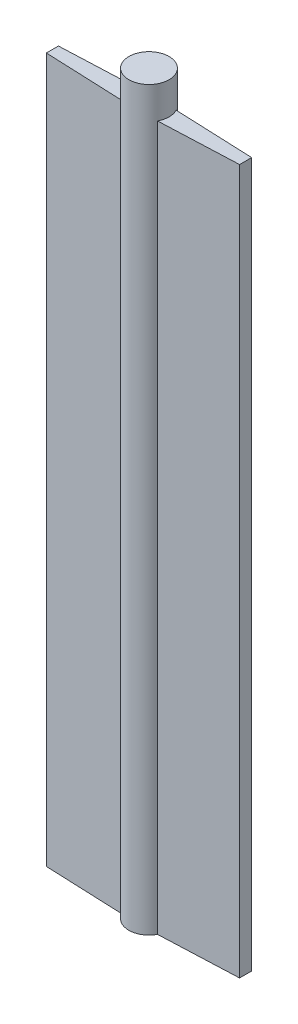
ISO-10303-21;
HEADER;
FILE_DESCRIPTION(('STEP AP214'),'2;1');
FILE_NAME('part.step','',(''),(''),'','','');
FILE_SCHEMA(('AUTOMOTIVE_DESIGN { 1 0 10303 214 1 1 1 1 }'));
ENDSEC;
DATA;
#1=APPLICATION_CONTEXT('core data for automotive mechanical design processes');
#2=APPLICATION_PROTOCOL_DEFINITION('international standard','automotive_design',2000,#1);
#3=PRODUCT_CONTEXT('',#1,'mechanical');
#4=PRODUCT('Part','Part','',(#3));
#5=PRODUCT_RELATED_PRODUCT_CATEGORY('part','',(#4));
#6=PRODUCT_DEFINITION_FORMATION('','',#4);
#7=PRODUCT_DEFINITION_CONTEXT('part definition',#1,'design');
#8=PRODUCT_DEFINITION('design','',#6,#7);
#9=PRODUCT_DEFINITION_SHAPE('','',#8);
#10=(LENGTH_UNIT() NAMED_UNIT(*) SI_UNIT(.MILLI.,.METRE.));
#11=(NAMED_UNIT(*) PLANE_ANGLE_UNIT() SI_UNIT($,.RADIAN.));
#12=(NAMED_UNIT(*) SI_UNIT($,.STERADIAN.) SOLID_ANGLE_UNIT());
#13=UNCERTAINTY_MEASURE_WITH_UNIT(LENGTH_MEASURE(1.E-05),#10,'distance_accuracy_value','');
#14=(GEOMETRIC_REPRESENTATION_CONTEXT(3) GLOBAL_UNCERTAINTY_ASSIGNED_CONTEXT((#13)) GLOBAL_UNIT_ASSIGNED_CONTEXT((#10,
#11,#12)) REPRESENTATION_CONTEXT('',''));
#15=CARTESIAN_POINT('',(0.,0.,0.));
#16=DIRECTION('',(0.,0.,1.));
#17=DIRECTION('',(1.,0.,0.));
#18=AXIS2_PLACEMENT_3D('',#15,#16,#17);
#19=CARTESIAN_POINT('',(0.,222.25,0.));
#20=DIRECTION('',(0.,1.,0.));
#21=DIRECTION('',(0.,0.,1.));
#22=AXIS2_PLACEMENT_3D('',#19,#20,#21);
#23=PLANE('',#22);
#24=CARTESIAN_POINT('',(0.,222.25,0.));
#25=DIRECTION('',(0.,1.,0.));
#26=DIRECTION('',(0.,0.,1.));
#27=AXIS2_PLACEMENT_3D('',#24,#25,#26);
#28=CIRCLE('',#27,6.35);
#29=CARTESIAN_POINT('',(5.62814310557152,222.25,2.94049403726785));
#30=VERTEX_POINT('',#29);
#31=CARTESIAN_POINT('',(5.62814310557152,222.25,-2.94049403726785));
#32=VERTEX_POINT('',#31);
#33=EDGE_CURVE('E80',#30,#32,#28,.T.);
#34=ORIENTED_EDGE('',*,*,#33,.F.);
#35=DIRECTION('',(-0.999133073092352,0.,0.0416305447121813));
#36=VECTOR('',#35,1.);
#37=CARTESIAN_POINT('',(0.132062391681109,222.25,3.16949740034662));
#38=LINE('',#37,#36);
#39=CARTESIAN_POINT('',(30.48,222.25,1.905));
#40=VERTEX_POINT('',#39);
#41=EDGE_CURVE('E182',#40,#30,#38,.T.);
#42=ORIENTED_EDGE('',*,*,#41,.F.);
#43=DIRECTION('',(0.,0.,1.));
#44=VECTOR('',#43,1.);
#45=CARTESIAN_POINT('',(30.48,222.25,0.));
#46=LINE('',#45,#44);
#47=CARTESIAN_POINT('',(30.48,222.25,-1.905));
#48=VERTEX_POINT('',#47);
#49=EDGE_CURVE('E205',#48,#40,#46,.T.);
#50=ORIENTED_EDGE('',*,*,#49,.F.);
#51=DIRECTION('',(0.999133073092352,0.,0.0416305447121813));
#52=VECTOR('',#51,1.);
#53=CARTESIAN_POINT('',(0.132062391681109,222.25,-3.16949740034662));
#54=LINE('',#53,#52);
#55=EDGE_CURVE('E177',#32,#48,#54,.T.);
#56=ORIENTED_EDGE('',*,*,#55,.F.);
#57=EDGE_LOOP('',(#34,#42,#50,#56));
#58=FACE_BOUND('',#57,.T.);
#59=ADVANCED_FACE('F68',(#58),#23,.T.);
#60=CARTESIAN_POINT('',(0.132062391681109,222.25,3.16949740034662));
#61=DIRECTION('',(0.0416305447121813,0.,0.999133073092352));
#62=DIRECTION('',(0.999133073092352,0.,-0.0416305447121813));
#63=AXIS2_PLACEMENT_3D('',#60,#61,#62);
#64=PLANE('',#63);
#65=DIRECTION('',(-0.999133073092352,0.,0.0416305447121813));
#66=VECTOR('',#65,1.);
#67=CARTESIAN_POINT('',(0.132062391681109,0.,3.16949740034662));
#68=LINE('',#67,#66);
#69=CARTESIAN_POINT('',(30.48,0.,1.905));
#70=VERTEX_POINT('',#69);
#71=CARTESIAN_POINT('',(5.62814310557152,0.,2.94049403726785));
#72=VERTEX_POINT('',#71);
#73=EDGE_CURVE('E154',#70,#72,#68,.T.);
#74=ORIENTED_EDGE('',*,*,#73,.F.);
#75=DIRECTION('',(0.,-1.,0.));
#76=VECTOR('',#75,1.);
#77=CARTESIAN_POINT('',(30.48,222.25,1.905));
#78=LINE('',#77,#76);
#79=EDGE_CURVE('E186',#40,#70,#78,.T.);
#80=ORIENTED_EDGE('',*,*,#79,.F.);
#81=ORIENTED_EDGE('',*,*,#41,.T.);
#82=DIRECTION('',(0.,-1.,0.));
#83=VECTOR('',#82,1.);
#84=CARTESIAN_POINT('',(5.62814310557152,222.25,2.94049403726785));
#85=LINE('',#84,#83);
#86=EDGE_CURVE('E78',#30,#72,#85,.T.);
#87=ORIENTED_EDGE('',*,*,#86,.T.);
#88=EDGE_LOOP('',(#74,#80,#81,#87));
#89=FACE_BOUND('',#88,.T.);
#90=ADVANCED_FACE('F216',(#89),#64,.T.);
#91=CARTESIAN_POINT('',(30.48,222.25,0.));
#92=DIRECTION('',(1.,0.,0.));
#93=DIRECTION('',(0.,0.,-1.));
#94=AXIS2_PLACEMENT_3D('',#91,#92,#93);
#95=PLANE('',#94);
#96=DIRECTION('',(0.,0.,1.));
#97=VECTOR('',#96,1.);
#98=CARTESIAN_POINT('',(30.48,0.,0.));
#99=LINE('',#98,#97);
#100=CARTESIAN_POINT('',(30.48,0.,-1.905));
#101=VERTEX_POINT('',#100);
#102=EDGE_CURVE('E172',#101,#70,#99,.T.);
#103=ORIENTED_EDGE('',*,*,#102,.F.);
#104=DIRECTION('',(0.,-1.,0.));
#105=VECTOR('',#104,1.);
#106=CARTESIAN_POINT('',(30.48,222.25,-1.905));
#107=LINE('',#106,#105);
#108=EDGE_CURVE('E184',#48,#101,#107,.T.);
#109=ORIENTED_EDGE('',*,*,#108,.F.);
#110=ORIENTED_EDGE('',*,*,#49,.T.);
#111=ORIENTED_EDGE('',*,*,#79,.T.);
#112=EDGE_LOOP('',(#103,#109,#110,#111));
#113=FACE_BOUND('',#112,.T.);
#114=ADVANCED_FACE('F218',(#113),#95,.T.);
#115=CARTESIAN_POINT('',(0.132062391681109,222.25,-3.16949740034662));
#116=DIRECTION('',(0.0416305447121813,0.,-0.999133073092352));
#117=DIRECTION('',(-0.999133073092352,0.,-0.0416305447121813));
#118=AXIS2_PLACEMENT_3D('',#115,#116,#117);
#119=PLANE('',#118);
#120=DIRECTION('',(0.999133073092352,0.,0.0416305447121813));
#121=VECTOR('',#120,1.);
#122=CARTESIAN_POINT('',(0.132062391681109,0.,-3.16949740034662));
#123=LINE('',#122,#121);
#124=CARTESIAN_POINT('',(5.62814310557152,0.,-2.94049403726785));
#125=VERTEX_POINT('',#124);
#126=EDGE_CURVE('E174',#125,#101,#123,.T.);
#127=ORIENTED_EDGE('',*,*,#126,.F.);
#128=DIRECTION('',(0.,-1.,0.));
#129=VECTOR('',#128,1.);
#130=CARTESIAN_POINT('',(5.62814310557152,222.25,-2.94049403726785));
#131=LINE('',#130,#129);
#132=EDGE_CURVE('E88',#32,#125,#131,.T.);
#133=ORIENTED_EDGE('',*,*,#132,.F.);
#134=ORIENTED_EDGE('',*,*,#55,.T.);
#135=ORIENTED_EDGE('',*,*,#108,.T.);
#136=EDGE_LOOP('',(#127,#133,#134,#135));
#137=FACE_BOUND('',#136,.T.);
#138=ADVANCED_FACE('F209',(#137),#119,.T.);
#139=CARTESIAN_POINT('',(0.,0.,0.));
#140=DIRECTION('',(0.,1.,0.));
#141=DIRECTION('',(0.,0.,1.));
#142=AXIS2_PLACEMENT_3D('',#139,#140,#141);
#143=PLANE('',#142);
#144=ORIENTED_EDGE('',*,*,#73,.T.);
#145=CARTESIAN_POINT('',(0.,0.,0.));
#146=DIRECTION('',(0.,1.,0.));
#147=DIRECTION('',(0.,0.,1.));
#148=AXIS2_PLACEMENT_3D('',#145,#146,#147);
#149=CIRCLE('',#148,6.35);
#150=CARTESIAN_POINT('',(-5.62814310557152,0.,2.94049403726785));
#151=VERTEX_POINT('',#150);
#152=EDGE_CURVE('E72',#151,#72,#149,.T.);
#153=ORIENTED_EDGE('',*,*,#152,.F.);
#154=DIRECTION('',(0.999133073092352,0.,0.0416305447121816));
#155=VECTOR('',#154,1.);
#156=CARTESIAN_POINT('',(-0.13206239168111,0.,3.16949740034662));
#157=LINE('',#156,#155);
#158=CARTESIAN_POINT('',(-30.48,0.,1.90499999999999));
#159=VERTEX_POINT('',#158);
#160=EDGE_CURVE('E151',#159,#151,#157,.T.);
#161=ORIENTED_EDGE('',*,*,#160,.F.);
#162=DIRECTION('',(0.,0.,1.));
#163=VECTOR('',#162,1.);
#164=CARTESIAN_POINT('',(-30.48,0.,0.));
#165=LINE('',#164,#163);
#166=CARTESIAN_POINT('',(-30.48,0.,-1.90499999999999));
#167=VERTEX_POINT('',#166);
#168=EDGE_CURVE('E130',#167,#159,#165,.T.);
#169=ORIENTED_EDGE('',*,*,#168,.F.);
#170=DIRECTION('',(-0.999133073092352,0.,0.0416305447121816));
#171=VECTOR('',#170,1.);
#172=CARTESIAN_POINT('',(-0.13206239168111,0.,-3.16949740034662));
#173=LINE('',#172,#171);
#174=CARTESIAN_POINT('',(-5.62814310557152,0.,-2.94049403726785));
#175=VERTEX_POINT('',#174);
#176=EDGE_CURVE('E155',#175,#167,#173,.T.);
#177=ORIENTED_EDGE('',*,*,#176,.F.);
#178=EDGE_CURVE('E156',#125,#175,#149,.T.);
#179=ORIENTED_EDGE('',*,*,#178,.F.);
#180=ORIENTED_EDGE('',*,*,#126,.T.);
#181=ORIENTED_EDGE('',*,*,#102,.T.);
#182=EDGE_LOOP('',(#144,#153,#161,#169,#177,#179,#180,#181));
#183=FACE_BOUND('',#182,.T.);
#184=ADVANCED_FACE('F150',(#183),#143,.F.);
#185=CARTESIAN_POINT('',(-5.62814310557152,222.25,-2.94049403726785));
#186=VERTEX_POINT('',#185);
#187=CARTESIAN_POINT('',(-5.62814310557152,222.25,2.94049403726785));
#188=VERTEX_POINT('',#187);
#189=EDGE_CURVE('E12',#186,#188,#28,.T.);
#190=ORIENTED_EDGE('',*,*,#189,.F.);
#191=DIRECTION('',(-0.999133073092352,0.,0.0416305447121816));
#192=VECTOR('',#191,1.);
#193=CARTESIAN_POINT('',(-0.13206239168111,222.25,-3.16949740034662));
#194=LINE('',#193,#192);
#195=CARTESIAN_POINT('',(-30.48,222.25,-1.90499999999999));
#196=VERTEX_POINT('',#195);
#197=EDGE_CURVE('E158',#186,#196,#194,.T.);
#198=ORIENTED_EDGE('',*,*,#197,.T.);
#199=DIRECTION('',(0.,0.,1.));
#200=VECTOR('',#199,1.);
#201=CARTESIAN_POINT('',(-30.48,222.25,0.));
#202=LINE('',#201,#200);
#203=CARTESIAN_POINT('',(-30.48,222.25,1.90499999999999));
#204=VERTEX_POINT('',#203);
#205=EDGE_CURVE('E160',#196,#204,#202,.T.);
#206=ORIENTED_EDGE('',*,*,#205,.T.);
#207=DIRECTION('',(0.999133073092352,0.,0.0416305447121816));
#208=VECTOR('',#207,1.);
#209=CARTESIAN_POINT('',(-0.13206239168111,222.25,3.16949740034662));
#210=LINE('',#209,#208);
#211=EDGE_CURVE('E146',#204,#188,#210,.T.);
#212=ORIENTED_EDGE('',*,*,#211,.T.);
#213=EDGE_LOOP('',(#190,#198,#206,#212));
#214=FACE_BOUND('',#213,.T.);
#215=ADVANCED_FACE('F196',(#214),#23,.T.);
#216=CARTESIAN_POINT('',(-30.48,222.25,0.));
#217=DIRECTION('',(1.,0.,0.));
#218=DIRECTION('',(0.,0.,-1.));
#219=AXIS2_PLACEMENT_3D('',#216,#217,#218);
#220=PLANE('',#219);
#221=ORIENTED_EDGE('',*,*,#168,.T.);
#222=DIRECTION('',(0.,-1.,0.));
#223=VECTOR('',#222,1.);
#224=CARTESIAN_POINT('',(-30.48,222.25,1.90499999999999));
#225=LINE('',#224,#223);
#226=EDGE_CURVE('E145',#204,#159,#225,.T.);
#227=ORIENTED_EDGE('',*,*,#226,.F.);
#228=ORIENTED_EDGE('',*,*,#205,.F.);
#229=DIRECTION('',(0.,-1.,0.));
#230=VECTOR('',#229,1.);
#231=CARTESIAN_POINT('',(-30.48,222.25,-1.90499999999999));
#232=LINE('',#231,#230);
#233=EDGE_CURVE('E166',#196,#167,#232,.T.);
#234=ORIENTED_EDGE('',*,*,#233,.T.);
#235=EDGE_LOOP('',(#221,#227,#228,#234));
#236=FACE_BOUND('',#235,.T.);
#237=ADVANCED_FACE('F194',(#236),#220,.F.);
#238=CARTESIAN_POINT('',(-0.13206239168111,222.25,3.16949740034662));
#239=DIRECTION('',(0.0416305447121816,0.,-0.999133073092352));
#240=DIRECTION('',(-0.999133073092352,0.,-0.0416305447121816));
#241=AXIS2_PLACEMENT_3D('',#238,#239,#240);
#242=PLANE('',#241);
#243=ORIENTED_EDGE('',*,*,#160,.T.);
#244=DIRECTION('',(0.,-1.,0.));
#245=VECTOR('',#244,1.);
#246=CARTESIAN_POINT('',(-5.62814310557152,222.25,2.94049403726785));
#247=LINE('',#246,#245);
#248=EDGE_CURVE('E135',#188,#151,#247,.T.);
#249=ORIENTED_EDGE('',*,*,#248,.F.);
#250=ORIENTED_EDGE('',*,*,#211,.F.);
#251=ORIENTED_EDGE('',*,*,#226,.T.);
#252=EDGE_LOOP('',(#243,#249,#250,#251));
#253=FACE_BOUND('',#252,.T.);
#254=ADVANCED_FACE('F157',(#253),#242,.F.);
#255=CARTESIAN_POINT('',(-0.13206239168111,222.25,-3.16949740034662));
#256=DIRECTION('',(0.0416305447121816,0.,0.999133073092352));
#257=DIRECTION('',(0.999133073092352,0.,-0.0416305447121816));
#258=AXIS2_PLACEMENT_3D('',#255,#256,#257);
#259=PLANE('',#258);
#260=ORIENTED_EDGE('',*,*,#176,.T.);
#261=ORIENTED_EDGE('',*,*,#233,.F.);
#262=ORIENTED_EDGE('',*,*,#197,.F.);
#263=DIRECTION('',(0.,-1.,0.));
#264=VECTOR('',#263,1.);
#265=CARTESIAN_POINT('',(-5.62814310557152,222.25,-2.94049403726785));
#266=LINE('',#265,#264);
#267=EDGE_CURVE('E167',#186,#175,#266,.T.);
#268=ORIENTED_EDGE('',*,*,#267,.T.);
#269=EDGE_LOOP('',(#260,#261,#262,#268));
#270=FACE_BOUND('',#269,.T.);
#271=ADVANCED_FACE('F191',(#270),#259,.F.);
#272=CARTESIAN_POINT('',(0.,222.25,0.));
#273=DIRECTION('',(0.,-1.,0.));
#274=DIRECTION('',(0.,0.,-1.));
#275=AXIS2_PLACEMENT_3D('',#272,#273,#274);
#276=CYLINDRICAL_SURFACE('',#275,6.35);
#277=ORIENTED_EDGE('',*,*,#86,.F.);
#278=ORIENTED_EDGE('',*,*,#33,.T.);
#279=ORIENTED_EDGE('',*,*,#132,.T.);
#280=ORIENTED_EDGE('',*,*,#178,.T.);
#281=ORIENTED_EDGE('',*,*,#267,.F.);
#282=ORIENTED_EDGE('',*,*,#189,.T.);
#283=ORIENTED_EDGE('',*,*,#248,.T.);
#284=ORIENTED_EDGE('',*,*,#152,.T.);
#285=EDGE_LOOP('',(#277,#278,#279,#280,#281,#282,#283,#284));
#286=FACE_BOUND('',#285,.T.);
#287=CARTESIAN_POINT('',(0.,232.41,0.));
#288=DIRECTION('',(0.,1.,0.));
#289=DIRECTION('',(0.,0.,1.));
#290=AXIS2_PLACEMENT_3D('',#287,#288,#289);
#291=CIRCLE('',#290,6.35);
#292=CARTESIAN_POINT('',(0.,232.41,6.35));
#293=VERTEX_POINT('',#292);
#294=EDGE_CURVE('E198',#293,#293,#291,.T.);
#295=ORIENTED_EDGE('',*,*,#294,.F.);
#296=EDGE_LOOP('',(#295));
#297=FACE_BOUND('',#296,.T.);
#298=ADVANCED_FACE('F70',(#286,#297),#276,.T.);
#299=CARTESIAN_POINT('',(0.,232.41,0.));
#300=DIRECTION('',(0.,1.,0.));
#301=DIRECTION('',(0.,0.,1.));
#302=AXIS2_PLACEMENT_3D('',#299,#300,#301);
#303=PLANE('',#302);
#304=ORIENTED_EDGE('',*,*,#294,.T.);
#305=EDGE_LOOP('',(#304));
#306=FACE_BOUND('',#305,.T.);
#307=ADVANCED_FACE('F240',(#306),#303,.T.);
#308=CLOSED_SHELL('',(#59,#90,#114,#138,#184,#215,#237,#254,#271,#298,#307));
#309=MANIFOLD_SOLID_BREP('B2',#308);
#310=ADVANCED_BREP_SHAPE_REPRESENTATION('',(#18,#309),#14);
#311=SHAPE_DEFINITION_REPRESENTATION(#9,#310);
ENDSEC;
END-ISO-10303-21;
